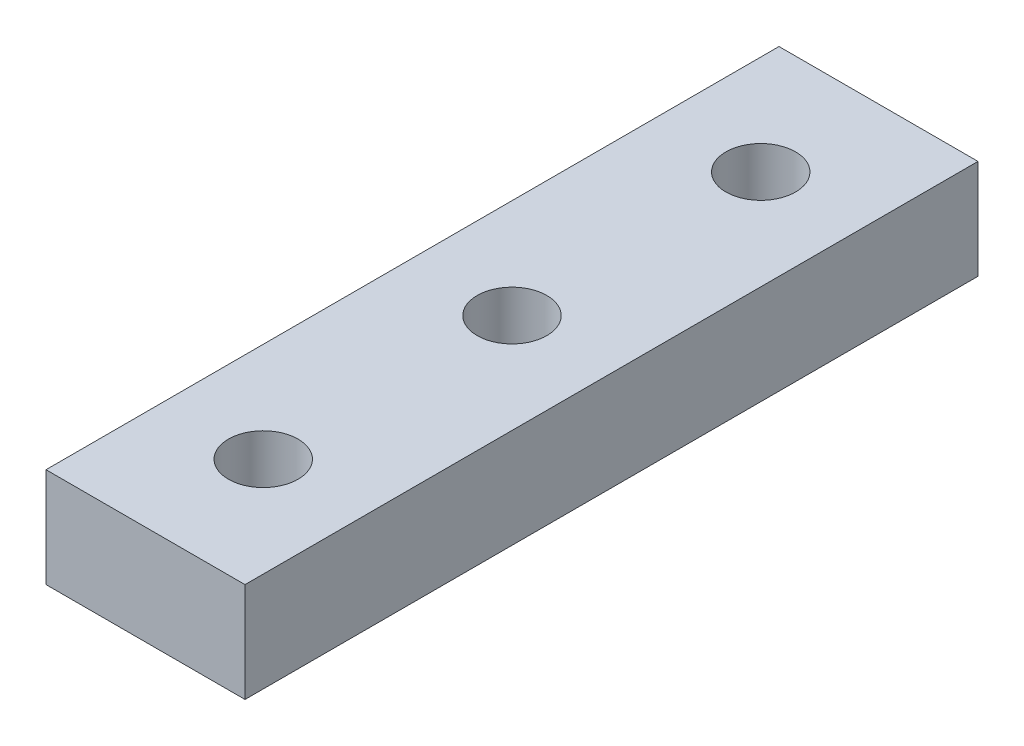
from build123d import *

# Parameters (mm, degrees)
SKETCH_1_W      = 12
SKETCH_1_H      = 44.2
SKETCH_1_R      = 2.1
EXTRUDE_1_DEPTH = 6


with BuildPart() as part:
    # Sketch 1 → Extrude 1 (new body)
    with BuildSketch(Plane(origin=(0, 0, 0), x_dir=(1, 0, 0), z_dir=(0, 1, 0))):
        with Locations((6, 22.1)):
            Rectangle(SKETCH_1_W, SKETCH_1_H)
        with Locations(Location((6, 22.1, 0), (0, 0, 270))):
            Circle(SKETCH_1_R, mode=Mode.SUBTRACT)
        with Locations(Location((6, 37.1, 0), (0, 0, 270))):
            Circle(SKETCH_1_R, mode=Mode.SUBTRACT)
        with Locations(Location((6, 7.1, 0), (0, 0, 270))):
            Circle(SKETCH_1_R, mode=Mode.SUBTRACT)
    extrude(amount=EXTRUDE_1_DEPTH)


solid = part.part
